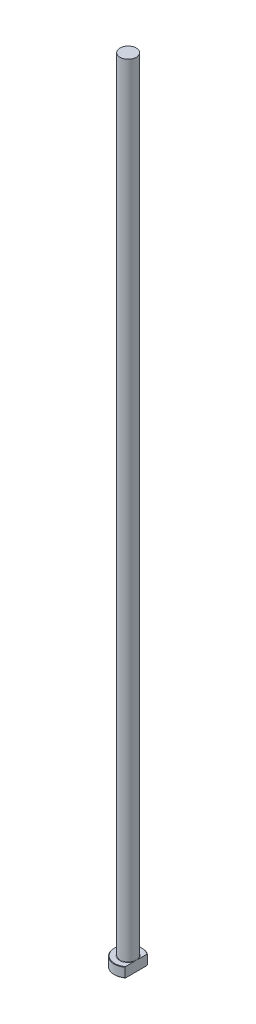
ISO-10303-21;
HEADER;
FILE_DESCRIPTION(('STEP AP214'),'2;1');
FILE_NAME('part.step','',(''),(''),'','','');
FILE_SCHEMA(('AUTOMOTIVE_DESIGN { 1 0 10303 214 1 1 1 1 }'));
ENDSEC;
DATA;
#1=APPLICATION_CONTEXT('core data for automotive mechanical design processes');
#2=APPLICATION_PROTOCOL_DEFINITION('international standard','automotive_design',2000,#1);
#3=PRODUCT_CONTEXT('',#1,'mechanical');
#4=PRODUCT('Part','Part','',(#3));
#5=PRODUCT_RELATED_PRODUCT_CATEGORY('part','',(#4));
#6=PRODUCT_DEFINITION_FORMATION('','',#4);
#7=PRODUCT_DEFINITION_CONTEXT('part definition',#1,'design');
#8=PRODUCT_DEFINITION('design','',#6,#7);
#9=PRODUCT_DEFINITION_SHAPE('','',#8);
#10=(LENGTH_UNIT() NAMED_UNIT(*) SI_UNIT(.MILLI.,.METRE.));
#11=(NAMED_UNIT(*) PLANE_ANGLE_UNIT() SI_UNIT($,.RADIAN.));
#12=(NAMED_UNIT(*) SI_UNIT($,.STERADIAN.) SOLID_ANGLE_UNIT());
#13=UNCERTAINTY_MEASURE_WITH_UNIT(LENGTH_MEASURE(1.E-05),#10,'distance_accuracy_value','');
#14=(GEOMETRIC_REPRESENTATION_CONTEXT(3) GLOBAL_UNCERTAINTY_ASSIGNED_CONTEXT((#13)) GLOBAL_UNIT_ASSIGNED_CONTEXT((#10,
#11,#12)) REPRESENTATION_CONTEXT('',''));
#15=CARTESIAN_POINT('',(0.,0.,0.));
#16=DIRECTION('',(0.,0.,1.));
#17=DIRECTION('',(1.,0.,0.));
#18=AXIS2_PLACEMENT_3D('',#15,#16,#17);
#19=CARTESIAN_POINT('',(0.,0.,0.));
#20=DIRECTION('',(0.,-1.,0.));
#21=DIRECTION('',(0.,0.,-1.));
#22=AXIS2_PLACEMENT_3D('',#19,#20,#21);
#23=PLANE('',#22);
#24=CARTESIAN_POINT('',(0.,0.,0.));
#25=DIRECTION('',(0.,-1.,0.));
#26=DIRECTION('',(0.,0.,-1.));
#27=AXIS2_PLACEMENT_3D('',#24,#25,#26);
#28=CIRCLE('',#27,6.79999999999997);
#29=CARTESIAN_POINT('',(4.09999999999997,0.,5.42494239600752));
#30=VERTEX_POINT('',#29);
#31=CARTESIAN_POINT('',(4.09999999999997,0.,-5.42494239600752));
#32=VERTEX_POINT('',#31);
#33=EDGE_CURVE('E98',#30,#32,#28,.T.);
#34=ORIENTED_EDGE('',*,*,#33,.T.);
#35=DIRECTION('',(0.,0.,1.));
#36=VECTOR('',#35,1.);
#37=CARTESIAN_POINT('',(4.09999999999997,0.,-5.6736231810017));
#38=LINE('',#37,#36);
#39=EDGE_CURVE('E83',#32,#30,#38,.T.);
#40=ORIENTED_EDGE('',*,*,#39,.T.);
#41=EDGE_LOOP('',(#34,#40));
#42=FACE_BOUND('',#41,.T.);
#43=ADVANCED_FACE('F32',(#42),#23,.T.);
#44=CARTESIAN_POINT('',(0.,259.958771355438,0.));
#45=DIRECTION('',(0.,1.,0.));
#46=DIRECTION('',(0.,0.,1.));
#47=AXIS2_PLACEMENT_3D('',#44,#45,#46);
#48=CYLINDRICAL_SURFACE('',#47,6.99999999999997);
#49=CARTESIAN_POINT('',(0.,4.80000000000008,0.));
#50=DIRECTION('',(0.,1.,0.));
#51=DIRECTION('',(0.,0.,1.));
#52=AXIS2_PLACEMENT_3D('',#49,#50,#51);
#53=CIRCLE('',#52,6.99999999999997);
#54=CARTESIAN_POINT('',(4.09999999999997,4.80000000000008,5.6736231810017));
#55=VERTEX_POINT('',#54);
#56=CARTESIAN_POINT('',(4.09999999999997,4.80000000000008,-5.6736231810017));
#57=VERTEX_POINT('',#56);
#58=EDGE_CURVE('E104',#55,#57,#53,.F.);
#59=ORIENTED_EDGE('',*,*,#58,.T.);
#60=DIRECTION('',(0.,-1.,0.));
#61=VECTOR('',#60,1.);
#62=CARTESIAN_POINT('',(4.09999999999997,400.,-5.6736231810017));
#63=LINE('',#62,#61);
#64=CARTESIAN_POINT('',(4.09999999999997,0.199999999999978,-5.6736231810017));
#65=VERTEX_POINT('',#64);
#66=EDGE_CURVE('E183',#57,#65,#63,.T.);
#67=ORIENTED_EDGE('',*,*,#66,.T.);
#68=CARTESIAN_POINT('',(0.,0.199999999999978,0.));
#69=DIRECTION('',(0.,-1.,0.));
#70=DIRECTION('',(0.,0.,-1.));
#71=AXIS2_PLACEMENT_3D('',#68,#69,#70);
#72=CIRCLE('',#71,6.99999999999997);
#73=CARTESIAN_POINT('',(4.09999999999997,0.199999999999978,5.6736231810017));
#74=VERTEX_POINT('',#73);
#75=EDGE_CURVE('E100',#65,#74,#72,.F.);
#76=ORIENTED_EDGE('',*,*,#75,.T.);
#77=DIRECTION('',(0.,-1.,0.));
#78=VECTOR('',#77,1.);
#79=CARTESIAN_POINT('',(4.09999999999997,400.,5.6736231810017));
#80=LINE('',#79,#78);
#81=EDGE_CURVE('E93',#55,#74,#80,.T.);
#82=ORIENTED_EDGE('',*,*,#81,.F.);
#83=EDGE_LOOP('',(#59,#67,#76,#82));
#84=FACE_BOUND('',#83,.T.);
#85=ADVANCED_FACE('F158',(#84),#48,.T.);
#86=CARTESIAN_POINT('',(-6.99999999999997,5.,0.));
#87=DIRECTION('',(0.,1.,0.));
#88=DIRECTION('',(0.,0.,1.));
#89=AXIS2_PLACEMENT_3D('',#86,#87,#88);
#90=PLANE('',#89);
#91=CARTESIAN_POINT('',(0.,5.,0.));
#92=DIRECTION('',(0.,1.,0.));
#93=DIRECTION('',(0.,0.,1.));
#94=AXIS2_PLACEMENT_3D('',#91,#92,#93);
#95=CIRCLE('',#94,6.80000000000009);
#96=CARTESIAN_POINT('',(4.09999999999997,5.,-5.42494239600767));
#97=VERTEX_POINT('',#96);
#98=CARTESIAN_POINT('',(4.09999999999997,5.,5.42494239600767));
#99=VERTEX_POINT('',#98);
#100=EDGE_CURVE('E178',#97,#99,#95,.T.);
#101=ORIENTED_EDGE('',*,*,#100,.T.);
#102=DIRECTION('',(0.,0.,-1.));
#103=VECTOR('',#102,1.);
#104=CARTESIAN_POINT('',(4.09999999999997,5.,0.));
#105=LINE('',#104,#103);
#106=CARTESIAN_POINT('',(4.09999999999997,4.99999999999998,1.29614813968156));
#107=VERTEX_POINT('',#106);
#108=EDGE_CURVE('E57',#99,#107,#105,.T.);
#109=ORIENTED_EDGE('',*,*,#108,.T.);
#110=CARTESIAN_POINT('',(0.,5.,0.));
#111=DIRECTION('',(0.,1.,0.));
#112=DIRECTION('',(0.,0.,1.));
#113=AXIS2_PLACEMENT_3D('',#110,#111,#112);
#114=CIRCLE('',#113,4.29999999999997);
#115=CARTESIAN_POINT('',(4.09999999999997,4.99999999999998,-1.29614813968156));
#116=VERTEX_POINT('',#115);
#117=EDGE_CURVE('E107',#107,#116,#114,.F.);
#118=ORIENTED_EDGE('',*,*,#117,.T.);
#119=EDGE_CURVE('E136',#116,#97,#105,.T.);
#120=ORIENTED_EDGE('',*,*,#119,.T.);
#121=EDGE_LOOP('',(#101,#109,#118,#120));
#122=FACE_BOUND('',#121,.T.);
#123=ADVANCED_FACE('F147',(#122),#90,.T.);
#124=CARTESIAN_POINT('',(0.,5.,0.));
#125=DIRECTION('',(0.,-1.,0.));
#126=DIRECTION('',(0.,0.,-1.));
#127=AXIS2_PLACEMENT_3D('',#124,#125,#126);
#128=CONICAL_SURFACE('',#127,6.80000000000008,0.785398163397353);
#129=ORIENTED_EDGE('',*,*,#58,.F.);
#130=CARTESIAN_POINT('',(4.09999999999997,-1.33929192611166,12.483228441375));
#131=CARTESIAN_POINT('',(4.09999999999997,-1.13691180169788,12.2702073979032));
#132=CARTESIAN_POINT('',(4.09999999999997,-0.934791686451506,12.0569390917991));
#133=CARTESIAN_POINT('',(4.09999999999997,-0.531169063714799,11.6298164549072));
#134=CARTESIAN_POINT('',(4.09999999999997,-0.329666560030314,11.4159621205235));
#135=CARTESIAN_POINT('',(4.09999999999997,0.273965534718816,10.7731725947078));
#136=CARTESIAN_POINT('',(4.09999999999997,0.67501715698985,10.3432236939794));
#137=CARTESIAN_POINT('',(4.09999999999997,1.47875431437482,9.47345436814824));
#138=CARTESIAN_POINT('',(4.09999999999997,1.88138218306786,9.03358046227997));
#139=CARTESIAN_POINT('',(4.09999999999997,2.48056970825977,8.36963259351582));
#140=CARTESIAN_POINT('',(4.09999999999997,2.67946853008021,8.147670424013));
#141=CARTESIAN_POINT('',(4.09999999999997,3.07530374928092,7.70200314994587));
#142=CARTESIAN_POINT('',(4.09999999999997,3.27224016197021,7.47829805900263));
#143=CARTESIAN_POINT('',(4.09999999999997,3.62803580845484,7.06959504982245));
#144=CARTESIAN_POINT('',(4.09999999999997,3.78730687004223,6.88495594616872));
#145=CARTESIAN_POINT('',(4.09999999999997,4.10378434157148,6.51391771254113));
#146=CARTESIAN_POINT('',(4.09999999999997,4.2609907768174,6.3275186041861));
#147=CARTESIAN_POINT('',(4.09999999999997,4.57299335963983,5.95235210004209));
#148=CARTESIAN_POINT('',(4.09999999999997,4.72778657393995,5.76358225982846));
#149=CARTESIAN_POINT('',(4.09999999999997,5.03405385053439,5.38337519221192));
#150=CARTESIAN_POINT('',(4.09999999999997,5.18552806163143,5.19193808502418));
#151=CARTESIAN_POINT('',(4.09999999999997,5.48381165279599,4.80616050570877));
#152=CARTESIAN_POINT('',(4.09999999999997,5.63063104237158,4.61182780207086));
#153=CARTESIAN_POINT('',(4.09999999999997,5.91857329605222,4.218895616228));
#154=CARTESIAN_POINT('',(4.09999999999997,6.05969490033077,4.02029520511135));
#155=CARTESIAN_POINT('',(4.09999999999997,6.3338461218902,3.61807653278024));
#156=CARTESIAN_POINT('',(4.09999999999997,6.46688994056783,3.41446801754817));
#157=CARTESIAN_POINT('',(4.09999999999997,6.72196289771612,3.0005132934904));
#158=CARTESIAN_POINT('',(4.09999999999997,6.8439982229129,2.79017096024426));
#159=CARTESIAN_POINT('',(4.09999999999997,7.04294800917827,2.41613627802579));
#160=CARTESIAN_POINT('',(4.09999999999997,7.12340018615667,2.25434092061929));
#161=CARTESIAN_POINT('',(4.09999999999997,7.27278814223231,1.92538984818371));
#162=CARTESIAN_POINT('',(4.09999999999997,7.34172134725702,1.7582329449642));
#163=CARTESIAN_POINT('',(4.09999999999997,7.46395062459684,1.41984946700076));
#164=CARTESIAN_POINT('',(4.09999999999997,7.51737823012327,1.24867129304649));
#165=CARTESIAN_POINT('',(4.09999999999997,7.6053948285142,0.901532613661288));
#166=CARTESIAN_POINT('',(4.09999999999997,7.63999996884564,0.725576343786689));
#167=CARTESIAN_POINT('',(4.09999999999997,7.68036353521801,0.421086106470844));
#168=CARTESIAN_POINT('',(4.09999999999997,7.69152054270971,0.293260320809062));
#169=CARTESIAN_POINT('',(4.09999999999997,7.70182627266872,0.0371280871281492));
#170=CARTESIAN_POINT('',(4.09999999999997,7.70097696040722,-0.0911782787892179));
#171=CARTESIAN_POINT('',(4.09999999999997,7.68730446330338,-0.347367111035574));
#172=CARTESIAN_POINT('',(4.09999999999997,7.67446010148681,-0.475248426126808));
#173=CARTESIAN_POINT('',(4.09999999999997,7.63752967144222,-0.729373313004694));
#174=CARTESIAN_POINT('',(4.09999999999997,7.6134410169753,-0.855616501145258));
#175=CARTESIAN_POINT('',(4.09999999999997,7.54404317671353,-1.15392625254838));
#176=CARTESIAN_POINT('',(4.09999999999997,7.49413451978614,-1.32492035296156));
#177=CARTESIAN_POINT('',(4.09999999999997,7.37892989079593,-1.66161692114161));
#178=CARTESIAN_POINT('',(4.09999999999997,7.31362410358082,-1.82731593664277));
#179=CARTESIAN_POINT('',(4.09999999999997,7.17079959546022,-2.15435858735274));
#180=CARTESIAN_POINT('',(4.09999999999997,7.0932172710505,-2.31567410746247));
#181=CARTESIAN_POINT('',(4.09999999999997,6.97004119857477,-2.55403843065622));
#182=CARTESIAN_POINT('',(4.09999999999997,6.92785402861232,-2.63288278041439));
#183=CARTESIAN_POINT('',(4.09999999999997,6.84148468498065,-2.78946923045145));
#184=CARTESIAN_POINT('',(4.09999999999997,6.79730258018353,-2.86721136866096));
#185=CARTESIAN_POINT('',(4.09999999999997,6.65934609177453,-3.10372248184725));
#186=CARTESIAN_POINT('',(4.09999999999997,6.56274427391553,-3.26084376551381));
#187=CARTESIAN_POINT('',(4.09999999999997,6.36389133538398,-3.57148434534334));
#188=CARTESIAN_POINT('',(4.09999999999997,6.26163896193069,-3.72500283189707));
#189=CARTESIAN_POINT('',(4.09999999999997,6.05267831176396,-4.02913378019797));
#190=CARTESIAN_POINT('',(4.09999999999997,5.9459667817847,-4.1797439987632));
#191=CARTESIAN_POINT('',(4.09999999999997,5.72908222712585,-4.47845767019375));
#192=CARTESIAN_POINT('',(4.09999999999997,5.61890895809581,-4.62656094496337));
#193=CARTESIAN_POINT('',(4.09999999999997,5.39553225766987,-4.92101937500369));
#194=CARTESIAN_POINT('',(4.09999999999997,5.2823221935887,-5.06736948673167));
#195=CARTESIAN_POINT('',(4.09999999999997,5.05364560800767,-5.3582983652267));
#196=CARTESIAN_POINT('',(4.09999999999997,4.93817902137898,-5.50287708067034));
#197=CARTESIAN_POINT('',(4.09999999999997,4.58900487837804,-5.93440610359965));
#198=CARTESIAN_POINT('',(4.09999999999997,4.35254037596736,-6.21912657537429));
#199=CARTESIAN_POINT('',(4.09999999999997,3.9936802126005,-6.64336157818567));
#200=CARTESIAN_POINT('',(4.09999999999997,3.87318866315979,-6.78450136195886));
#201=CARTESIAN_POINT('',(4.09999999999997,3.63111125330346,-7.06582575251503));
#202=CARTESIAN_POINT('',(4.09999999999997,3.50952546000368,-7.20601041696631));
#203=CARTESIAN_POINT('',(4.09999999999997,3.14334067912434,-7.62537642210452));
#204=CARTESIAN_POINT('',(4.09999999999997,2.89734299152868,-7.90333600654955));
#205=CARTESIAN_POINT('',(4.09999999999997,2.4029383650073,-8.4563615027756));
#206=CARTESIAN_POINT('',(4.09999999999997,2.15453550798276,-8.73143107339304));
#207=CARTESIAN_POINT('',(4.09999999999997,1.65560568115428,-9.2796352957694));
#208=CARTESIAN_POINT('',(4.09999999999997,1.40507871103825,-9.55276994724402));
#209=CARTESIAN_POINT('',(4.09999999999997,0.947239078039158,-10.0488717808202));
#210=CARTESIAN_POINT('',(4.09999999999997,0.740197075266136,-10.2720890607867));
#211=CARTESIAN_POINT('',(4.09999999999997,0.325116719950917,-10.7177199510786));
#212=CARTESIAN_POINT('',(4.09999999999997,0.117078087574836,-10.9401333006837));
#213=CARTESIAN_POINT('',(4.09999999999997,-0.298674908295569,-11.383046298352));
#214=CARTESIAN_POINT('',(4.09999999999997,-0.506385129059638,-11.6035498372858));
#215=CARTESIAN_POINT('',(4.09999999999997,-0.922403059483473,-12.0438652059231));
#216=CARTESIAN_POINT('',(4.09999999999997,-1.13071056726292,-12.2636772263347));
#217=CARTESIAN_POINT('',(4.09999999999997,-1.33929192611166,-12.483228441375));
#218=B_SPLINE_CURVE_WITH_KNOTS('',3,(#130,#131,#132,#133,#134,#135,#136,#137,#138,#139,#140,
#141,#142,#143,#144,#145,#146,#147,#148,#149,#150,#151,#152,#153,#154,#155,#156,#157,#158,#159,
#160,#161,#162,#163,#164,#165,#166,#167,#168,#169,#170,#171,#172,#173,#174,#175,#176,#177,#178,
#179,#180,#181,#182,#183,#184,#185,#186,#187,#188,#189,#190,#191,#192,#193,#194,#195,#196,#197,
#198,#199,#200,#201,#202,#203,#204,#205,#206,#207,#208,#209,#210,#211,#212,#213,#214,#215,#216,
#217),.UNSPECIFIED.,.F.,.F.,(4,2,2,2,2,2,2,2,2,2,2,2,2,2,2,2,2,2,2,2,2,2,2,2,2,2,2,2,2,2,2,2,2,
2,2,2,2,2,2,2,2,2,2,4),(0.,0.881487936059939,1.76298129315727,3.52684938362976,5.31576438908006,
6.20987642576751,7.10398148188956,7.83549529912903,8.56700014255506,9.29933394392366,
10.0316348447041,10.7622363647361,11.4929985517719,12.2224363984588,12.9514617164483,
13.4932089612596,14.0350771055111,14.572204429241,15.1088702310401,15.4932846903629,
15.8776362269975,16.2626676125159,16.6477876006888,17.181194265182,17.7149418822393,
18.2515512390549,18.5197937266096,18.788026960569,19.3411787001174,19.8944535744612,
20.44813940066,21.0018643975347,21.556917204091,22.1119860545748,23.2222096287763,
23.7789368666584,24.3356301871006,25.4491497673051,26.5610293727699,27.6729091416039,
28.5862688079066,29.4999020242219,30.4086844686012,31.3171893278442),.UNSPECIFIED.);
#219=EDGE_CURVE('E135',#55,#99,#218,.T.);
#220=ORIENTED_EDGE('',*,*,#219,.T.);
#221=ORIENTED_EDGE('',*,*,#100,.F.);
#222=EDGE_CURVE('E127',#97,#57,#218,.T.);
#223=ORIENTED_EDGE('',*,*,#222,.T.);
#224=EDGE_LOOP('',(#129,#220,#221,#223));
#225=FACE_BOUND('',#224,.T.);
#226=ADVANCED_FACE('F143',(#225),#128,.T.);
#227=CARTESIAN_POINT('',(0.,0.199999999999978,0.));
#228=DIRECTION('',(0.,1.,0.));
#229=DIRECTION('',(0.,0.,1.));
#230=AXIS2_PLACEMENT_3D('',#227,#228,#229);
#231=CONICAL_SURFACE('',#230,6.99999999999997,0.785398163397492);
#232=ORIENTED_EDGE('',*,*,#75,.F.);
#233=CARTESIAN_POINT('',(4.09999999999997,6.33929192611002,-12.483228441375));
#234=CARTESIAN_POINT('',(4.09999999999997,6.13691180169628,-12.2702073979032));
#235=CARTESIAN_POINT('',(4.09999999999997,5.93479168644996,-12.0569390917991));
#236=CARTESIAN_POINT('',(4.09999999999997,5.53116906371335,-11.6298164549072));
#237=CARTESIAN_POINT('',(4.09999999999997,5.32966656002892,-11.4159621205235));
#238=CARTESIAN_POINT('',(4.09999999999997,4.72603446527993,-10.7731725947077));
#239=CARTESIAN_POINT('',(4.09999999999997,4.324982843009,-10.3432236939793));
#240=CARTESIAN_POINT('',(4.09999999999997,3.52124568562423,-9.47345436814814));
#241=CARTESIAN_POINT('',(4.09999999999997,3.11861781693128,-9.03358046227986));
#242=CARTESIAN_POINT('',(4.09999999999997,2.51943029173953,-8.36963259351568));
#243=CARTESIAN_POINT('',(4.09999999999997,2.32053146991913,-8.14767042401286));
#244=CARTESIAN_POINT('',(4.09999999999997,1.92469625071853,-7.70200314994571));
#245=CARTESIAN_POINT('',(4.09999999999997,1.72775983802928,-7.47829805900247));
#246=CARTESIAN_POINT('',(4.09999999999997,1.37196419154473,-7.06959504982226));
#247=CARTESIAN_POINT('',(4.09999999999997,1.21269312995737,-6.88495594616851));
#248=CARTESIAN_POINT('',(4.09999999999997,0.896215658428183,-6.51391771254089));
#249=CARTESIAN_POINT('',(4.09999999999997,0.739009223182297,-6.32751860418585));
#250=CARTESIAN_POINT('',(4.09999999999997,0.427006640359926,-5.9523521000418));
#251=CARTESIAN_POINT('',(4.09999999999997,0.272213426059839,-5.76358225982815));
#252=CARTESIAN_POINT('',(4.09999999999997,-0.0340538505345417,-5.38337519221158));
#253=CARTESIAN_POINT('',(4.09999999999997,-0.185528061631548,-5.19193808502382));
#254=CARTESIAN_POINT('',(4.09999999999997,-0.483811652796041,-4.80616050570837));
#255=CARTESIAN_POINT('',(4.09999999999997,-0.630631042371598,-4.61182780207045));
#256=CARTESIAN_POINT('',(4.09999999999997,-0.918573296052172,-4.21889561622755));
#257=CARTESIAN_POINT('',(4.09999999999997,-1.05969490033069,-4.02029520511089));
#258=CARTESIAN_POINT('',(4.09999999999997,-1.33384612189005,-3.61807653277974));
#259=CARTESIAN_POINT('',(4.09999999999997,-1.46688994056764,-3.41446801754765));
#260=CARTESIAN_POINT('',(4.09999999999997,-1.72196289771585,-3.00051329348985));
#261=CARTESIAN_POINT('',(4.09999999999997,-1.84399822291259,-2.7901709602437));
#262=CARTESIAN_POINT('',(4.09999999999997,-2.0429480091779,-2.41613627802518));
#263=CARTESIAN_POINT('',(4.09999999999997,-2.12340018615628,-2.25434092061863));
#264=CARTESIAN_POINT('',(4.09999999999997,-2.27278814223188,-1.92538984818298));
#265=CARTESIAN_POINT('',(4.09999999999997,-2.34172134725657,-1.75823294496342));
#266=CARTESIAN_POINT('',(4.09999999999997,-2.46395062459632,-1.4198494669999));
#267=CARTESIAN_POINT('',(4.09999999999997,-2.51737823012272,-1.2486712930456));
#268=CARTESIAN_POINT('',(4.09999999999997,-2.60539482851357,-0.901532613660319));
#269=CARTESIAN_POINT('',(4.09999999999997,-2.63999996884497,-0.725576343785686));
#270=CARTESIAN_POINT('',(4.09999999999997,-2.68036353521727,-0.421086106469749));
#271=CARTESIAN_POINT('',(4.09999999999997,-2.69152054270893,-0.293260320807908));
#272=CARTESIAN_POINT('',(4.09999999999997,-2.70182627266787,-0.0371280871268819));
#273=CARTESIAN_POINT('',(4.09999999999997,-2.70097696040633,0.0911782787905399));
#274=CARTESIAN_POINT('',(4.09999999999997,-2.6873044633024,0.347367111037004));
#275=CARTESIAN_POINT('',(4.09999999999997,-2.67446010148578,0.475248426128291));
#276=CARTESIAN_POINT('',(4.09999999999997,-2.63752967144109,0.729373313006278));
#277=CARTESIAN_POINT('',(4.09999999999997,-2.61344101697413,0.855616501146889));
#278=CARTESIAN_POINT('',(4.09999999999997,-2.54404317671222,1.15392625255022));
#279=CARTESIAN_POINT('',(4.09999999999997,-2.49413451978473,1.32492035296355));
#280=CARTESIAN_POINT('',(4.09999999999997,-2.3789298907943,1.6616169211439));
#281=CARTESIAN_POINT('',(4.09999999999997,-2.31362410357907,1.82731593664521));
#282=CARTESIAN_POINT('',(4.09999999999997,-2.17079959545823,2.15435858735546));
#283=CARTESIAN_POINT('',(4.09999999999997,-2.0932172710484,2.31567410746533));
#284=CARTESIAN_POINT('',(4.09999999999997,-1.97004119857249,2.55403843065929));
#285=CARTESIAN_POINT('',(4.09999999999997,-1.92785402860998,2.63288278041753));
#286=CARTESIAN_POINT('',(4.09999999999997,-1.84148468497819,2.78946923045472));
#287=CARTESIAN_POINT('',(4.09999999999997,-1.797302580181,2.86721136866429));
#288=CARTESIAN_POINT('',(4.09999999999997,-1.65934609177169,3.10372248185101));
#289=CARTESIAN_POINT('',(4.09999999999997,-1.56274427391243,3.26084376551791));
#290=CARTESIAN_POINT('',(4.09999999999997,-1.36389133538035,3.57148434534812));
#291=CARTESIAN_POINT('',(4.09999999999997,-1.26163896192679,3.72500283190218));
#292=CARTESIAN_POINT('',(4.09999999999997,-1.0526783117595,4.02913378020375));
#293=CARTESIAN_POINT('',(4.09999999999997,-0.945966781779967,4.1797439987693));
#294=CARTESIAN_POINT('',(4.09999999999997,-0.72908222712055,4.47845767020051));
#295=CARTESIAN_POINT('',(4.09999999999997,-0.618908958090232,4.62656094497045));
#296=CARTESIAN_POINT('',(4.09999999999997,-0.395532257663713,4.92101937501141));
#297=CARTESIAN_POINT('',(4.09999999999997,-0.282322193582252,5.06736948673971));
#298=CARTESIAN_POINT('',(4.09999999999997,-0.0536456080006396,5.35829836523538));
#299=CARTESIAN_POINT('',(4.09999999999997,0.0618209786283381,5.50287708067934));
#300=CARTESIAN_POINT('',(4.09999999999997,0.41099512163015,5.9344061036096));
#301=CARTESIAN_POINT('',(4.09999999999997,0.647459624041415,6.21912657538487));
#302=CARTESIAN_POINT('',(4.09999999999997,1.00631978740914,6.6433615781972));
#303=CARTESIAN_POINT('',(4.09999999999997,1.12681133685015,6.7845013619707));
#304=CARTESIAN_POINT('',(4.09999999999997,1.36888874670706,7.0658257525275));
#305=CARTESIAN_POINT('',(4.09999999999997,1.49047454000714,7.20601041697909));
#306=CARTESIAN_POINT('',(4.09999999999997,1.85665932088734,7.62537642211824));
#307=CARTESIAN_POINT('',(4.09999999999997,2.10265700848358,7.90333600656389));
#308=CARTESIAN_POINT('',(4.09999999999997,2.59706163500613,8.4563615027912));
#309=CARTESIAN_POINT('',(4.09999999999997,2.84546449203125,8.73143107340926));
#310=CARTESIAN_POINT('',(4.09999999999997,3.34439431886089,9.27963529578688));
#311=CARTESIAN_POINT('',(4.09999999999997,3.5949212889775,9.55276994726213));
#312=CARTESIAN_POINT('',(4.09999999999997,4.0527609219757,10.0488717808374));
#313=CARTESIAN_POINT('',(4.09999999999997,4.25980292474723,10.2720890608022));
#314=CARTESIAN_POINT('',(4.09999999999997,4.67488328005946,10.717719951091));
#315=CARTESIAN_POINT('',(4.09999999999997,4.88292191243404,10.9401333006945));
#316=CARTESIAN_POINT('',(4.09999999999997,5.29867490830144,11.3830462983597));
#317=CARTESIAN_POINT('',(4.09999999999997,5.50638512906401,11.603549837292));
#318=CARTESIAN_POINT('',(4.09999999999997,5.92240305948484,12.0438652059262));
#319=CARTESIAN_POINT('',(4.09999999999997,6.13071056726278,12.2636772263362));
#320=CARTESIAN_POINT('',(4.09999999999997,6.33929192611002,12.483228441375));
#321=B_SPLINE_CURVE_WITH_KNOTS('',3,(#233,#234,#235,#236,#237,#238,#239,#240,#241,#242,#243,
#244,#245,#246,#247,#248,#249,#250,#251,#252,#253,#254,#255,#256,#257,#258,#259,#260,#261,#262,
#263,#264,#265,#266,#267,#268,#269,#270,#271,#272,#273,#274,#275,#276,#277,#278,#279,#280,#281,
#282,#283,#284,#285,#286,#287,#288,#289,#290,#291,#292,#293,#294,#295,#296,#297,#298,#299,#300,
#301,#302,#303,#304,#305,#306,#307,#308,#309,#310,#311,#312,#313,#314,#315,#316,#317,#318,#319,
#320),.UNSPECIFIED.,.F.,.F.,(4,2,2,2,2,2,2,2,2,2,2,2,2,2,2,2,2,2,2,2,2,2,2,2,2,2,2,2,2,2,2,2,2,
2,2,2,2,2,2,2,2,2,2,4),(0.,0.881487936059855,1.7629812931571,3.52684938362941,5.31576438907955,
6.20987642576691,7.10398148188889,7.83549529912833,8.56700014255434,9.29933394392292,
10.0316348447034,10.7622363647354,11.4929985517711,12.222436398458,12.9514617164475,
13.4932089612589,14.0350771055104,14.5722044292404,15.1088702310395,15.4932846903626,
15.8776362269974,16.2626676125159,16.647787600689,17.1811942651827,17.7149418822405,
18.2515512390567,18.5197937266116,18.7880269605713,19.3411787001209,19.8944535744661,
20.4481394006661,21.0018643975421,21.5569172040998,22.1119860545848,23.2222096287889,
23.7789368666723,24.3356301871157,25.4491497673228,26.5610293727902,27.6729091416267,
28.5862688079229,29.4999020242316,30.4086844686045,31.3171893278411),.UNSPECIFIED.);
#322=EDGE_CURVE('E86',#65,#32,#321,.T.);
#323=ORIENTED_EDGE('',*,*,#322,.T.);
#324=ORIENTED_EDGE('',*,*,#33,.F.);
#325=EDGE_CURVE('E89',#30,#74,#321,.T.);
#326=ORIENTED_EDGE('',*,*,#325,.T.);
#327=EDGE_LOOP('',(#232,#323,#324,#326));
#328=FACE_BOUND('',#327,.T.);
#329=ADVANCED_FACE('F97',(#328),#231,.T.);
#330=CARTESIAN_POINT('',(0.,5.19999999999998,0.));
#331=DIRECTION('',(0.,1.,0.));
#332=DIRECTION('',(0.,0.,1.));
#333=AXIS2_PLACEMENT_3D('',#330,#331,#332);
#334=TOROIDAL_SURFACE('',#333,4.29999999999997,0.2);
#335=CARTESIAN_POINT('',(4.09999999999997,5.19999999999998,0.));
#336=CARTESIAN_POINT('',(4.09999999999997,5.20000051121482,8.48177579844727E-11));
#337=CARTESIAN_POINT('',(4.09999999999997,5.2000010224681,-2.37341874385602E-07));
#338=CARTESIAN_POINT('',(4.09999999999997,5.20000197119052,-8.69991321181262E-07));
#339=CARTESIAN_POINT('',(4.09999999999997,5.20000238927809,-1.28223494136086E-06));
#340=CARTESIAN_POINT('',(4.09999999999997,5.20000327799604,-2.27653388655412E-06));
#341=CARTESIAN_POINT('',(4.09999999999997,5.20000373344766,-2.87471299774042E-06));
#342=CARTESIAN_POINT('',(4.09999999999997,5.20000453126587,-4.09830357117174E-06));
#343=CARTESIAN_POINT('',(4.09999999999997,5.20000487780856,-4.72126748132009E-06));
#344=CARTESIAN_POINT('',(4.09999999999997,5.20000620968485,-7.19543436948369E-06));
#345=CARTESIAN_POINT('',(4.09999999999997,5.20000713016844,-9.08507628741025E-06));
#346=CARTESIAN_POINT('',(4.09999999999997,5.20000860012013,-1.27786167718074E-05));
#347=CARTESIAN_POINT('',(4.09999999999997,5.2000091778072,-1.45716794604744E-05));
#348=CARTESIAN_POINT('',(4.09999999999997,5.20001167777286,-2.23278313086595E-05));
#349=CARTESIAN_POINT('',(4.09999999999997,5.20001360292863,-2.82919348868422E-05));
#350=CARTESIAN_POINT('',(4.09999999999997,5.20001636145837,-3.94393207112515E-05));
#351=CARTESIAN_POINT('',(4.09999999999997,5.20001732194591,-4.459065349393E-05));
#352=CARTESIAN_POINT('',(4.09999999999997,5.20002443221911,-8.33481274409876E-05));
#353=CARTESIAN_POINT('',(4.09999999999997,5.20002995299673,-0.000117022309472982));
#354=CARTESIAN_POINT('',(4.09999999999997,5.20005411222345,-0.000250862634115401));
#355=CARTESIAN_POINT('',(4.09999999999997,5.20007702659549,-0.000350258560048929));
#356=CARTESIAN_POINT('',(4.09999999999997,5.20016686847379,-0.000745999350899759));
#357=CARTESIAN_POINT('',(4.09999999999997,5.20023113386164,-0.00104273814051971));
#358=CARTESIAN_POINT('',(4.09999999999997,5.20048975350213,-0.00222871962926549));
#359=CARTESIAN_POINT('',(4.09999999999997,5.20068752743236,-0.00311743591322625));
#360=CARTESIAN_POINT('',(4.09999999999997,5.20151360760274,-0.00683863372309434));
#361=CARTESIAN_POINT('',(4.09999999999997,5.20213761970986,-0.00967177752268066));
#362=CARTESIAN_POINT('',(4.09999999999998,5.21060513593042,-0.0481053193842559));
#363=CARTESIAN_POINT('',(4.09999999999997,5.21847514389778,-0.0837019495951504));
#364=CARTESIAN_POINT('',(4.09999999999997,5.23497753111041,-0.15888321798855));
#365=CARTESIAN_POINT('',(4.09999999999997,5.24359721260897,-0.198470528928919));
#366=CARTESIAN_POINT('',(4.09999999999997,5.25810552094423,-0.266014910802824));
#367=CARTESIAN_POINT('',(4.09999999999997,5.26405008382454,-0.293959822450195));
#368=CARTESIAN_POINT('',(4.09999999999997,5.27562355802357,-0.34912552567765));
#369=CARTESIAN_POINT('',(4.09999999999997,5.28125665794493,-0.376345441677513));
#370=CARTESIAN_POINT('',(4.09999999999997,5.29943979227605,-0.46575599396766));
#371=CARTESIAN_POINT('',(4.09999999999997,5.31159607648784,-0.528028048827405));
#372=CARTESIAN_POINT('',(4.09999999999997,5.3345183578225,-0.653452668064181));
#373=CARTESIAN_POINT('',(4.09999999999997,5.34526982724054,-0.716607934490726));
#374=CARTESIAN_POINT('',(4.09999999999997,5.36549989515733,-0.849208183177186));
#375=CARTESIAN_POINT('',(4.09999999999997,5.37476398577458,-0.918686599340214));
#376=CARTESIAN_POINT('',(4.09999999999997,5.38955225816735,-1.05786044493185));
#377=CARTESIAN_POINT('',(4.09999999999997,5.39508786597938,-1.12755454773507));
#378=CARTESIAN_POINT('',(4.09999999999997,5.3992964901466,-1.23112590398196));
#379=CARTESIAN_POINT('',(4.09999999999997,5.40003705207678,-1.26491756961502));
#380=CARTESIAN_POINT('',(4.09999999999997,5.39995996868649,-1.33249559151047));
#381=CARTESIAN_POINT('',(4.09999999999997,5.39914270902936,-1.36628194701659));
#382=CARTESIAN_POINT('',(4.09999999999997,5.39557880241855,-1.43339843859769));
#383=CARTESIAN_POINT('',(4.09999999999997,5.39285312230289,-1.46672955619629));
#384=CARTESIAN_POINT('',(4.09999999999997,5.3849220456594,-1.53304911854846));
#385=CARTESIAN_POINT('',(4.09999999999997,5.37972044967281,-1.56603800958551));
#386=CARTESIAN_POINT('',(4.09999999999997,5.36576321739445,-1.63210333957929));
#387=CARTESIAN_POINT('',(4.09999999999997,5.35693238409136,-1.66516593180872));
#388=CARTESIAN_POINT('',(4.09999999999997,5.33956496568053,-1.71313701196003));
#389=CARTESIAN_POINT('',(4.09999999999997,5.33312382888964,-1.72879572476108));
#390=CARTESIAN_POINT('',(4.09999999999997,5.31841020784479,-1.75921181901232));
#391=CARTESIAN_POINT('',(4.09999999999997,5.31014484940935,-1.77397243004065));
#392=CARTESIAN_POINT('',(4.09999999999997,5.29597609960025,-1.79459137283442));
#393=CARTESIAN_POINT('',(4.09999999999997,5.29105059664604,-1.80111732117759));
#394=CARTESIAN_POINT('',(4.09999999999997,5.28047159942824,-1.81356806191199));
#395=CARTESIAN_POINT('',(4.09999999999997,5.27481806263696,-1.81949281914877));
#396=CARTESIAN_POINT('',(4.09999999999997,5.26378662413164,-1.82942177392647));
#397=CARTESIAN_POINT('',(4.09999999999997,5.25854825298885,-1.83357893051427));
#398=CARTESIAN_POINT('',(4.09999999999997,5.24747881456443,-1.8410175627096));
#399=CARTESIAN_POINT('',(4.09999999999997,5.24164898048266,-1.84430081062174));
#400=CARTESIAN_POINT('',(4.09999999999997,5.23103019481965,-1.84897077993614));
#401=CARTESIAN_POINT('',(4.09999999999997,5.22636142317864,-1.85062832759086));
#402=CARTESIAN_POINT('',(4.09999999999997,5.21681344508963,-1.85314556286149));
#403=CARTESIAN_POINT('',(4.09999999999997,5.21193447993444,-1.85400614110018));
#404=CARTESIAN_POINT('',(4.09999999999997,5.2020790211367,-1.8548454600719));
#405=CARTESIAN_POINT('',(4.09999999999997,5.19710220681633,-1.85482052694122));
#406=CARTESIAN_POINT('',(4.09999999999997,5.18723254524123,-1.85388227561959));
#407=CARTESIAN_POINT('',(4.09999999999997,5.18233974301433,-1.8529684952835));
#408=CARTESIAN_POINT('',(4.09999999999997,5.17301169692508,-1.85041011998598));
#409=CARTESIAN_POINT('',(4.09999999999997,5.16856577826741,-1.84880345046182));
#410=CARTESIAN_POINT('',(4.09999999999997,5.15994310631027,-1.84499014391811));
#411=CARTESIAN_POINT('',(4.09999999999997,5.15576643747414,-1.84278331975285));
#412=CARTESIAN_POINT('',(4.09999999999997,5.1448604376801,-1.83616140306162));
#413=CARTESIAN_POINT('',(4.09999999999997,5.13841060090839,-1.8312871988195));
#414=CARTESIAN_POINT('',(4.09999999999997,5.12632402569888,-1.82061430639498));
#415=CARTESIAN_POINT('',(4.09999999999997,5.12069027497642,-1.81481237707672));
#416=CARTESIAN_POINT('',(4.09999999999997,5.10569835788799,-1.79748307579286));
#417=CARTESIAN_POINT('',(4.09999999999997,5.0971810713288,-1.78523612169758));
#418=CARTESIAN_POINT('',(4.09999999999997,5.08190874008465,-1.759730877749));
#419=CARTESIAN_POINT('',(4.09999999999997,5.07515617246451,-1.74647119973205));
#420=CARTESIAN_POINT('',(4.09999999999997,5.06057670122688,-1.71404296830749));
#421=CARTESIAN_POINT('',(4.09999999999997,5.05336936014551,-1.69459894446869));
#422=CARTESIAN_POINT('',(4.09999999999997,5.04078670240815,-1.65511361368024));
#423=CARTESIAN_POINT('',(4.09999999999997,5.03541518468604,-1.63507116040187));
#424=CARTESIAN_POINT('',(4.09999999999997,5.02602669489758,-1.59438056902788));
#425=CARTESIAN_POINT('',(4.09999999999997,5.02202979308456,-1.57372787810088));
#426=CARTESIAN_POINT('',(4.09999999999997,5.01520764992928,-1.53226128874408));
#427=CARTESIAN_POINT('',(4.09999999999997,5.01238102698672,-1.51144761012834));
#428=CARTESIAN_POINT('',(4.09999999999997,5.00618826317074,-1.45642510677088));
#429=CARTESIAN_POINT('',(4.09999999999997,5.00362476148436,-1.42212636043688));
#430=CARTESIAN_POINT('',(4.09999999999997,5.00045800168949,-1.35343324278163));
#431=CARTESIAN_POINT('',(4.09999999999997,4.99985588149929,-1.31903882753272));
#432=CARTESIAN_POINT('',(4.09999999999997,5.00037893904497,-1.21560964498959));
#433=CARTESIAN_POINT('',(4.09999999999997,5.00385566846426,-1.14658832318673));
#434=CARTESIAN_POINT('',(4.09999999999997,5.01464295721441,-1.01357004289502));
#435=CARTESIAN_POINT('',(4.09999999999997,5.02167983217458,-0.949547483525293));
#436=CARTESIAN_POINT('',(4.09999999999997,5.03833051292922,-0.822416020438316));
#437=CARTESIAN_POINT('',(4.09999999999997,5.04792112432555,-0.759304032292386));
#438=CARTESIAN_POINT('',(4.09999999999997,5.06649836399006,-0.648156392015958));
#439=CARTESIAN_POINT('',(4.09999999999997,5.07509963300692,-0.60005440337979));
#440=CARTESIAN_POINT('',(4.09999999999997,5.09336865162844,-0.5027171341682));
#441=CARTESIAN_POINT('',(4.09999999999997,5.10305882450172,-0.45348607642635));
#442=CARTESIAN_POINT('',(4.09999999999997,5.12010265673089,-0.369650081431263));
#443=CARTESIAN_POINT('',(4.09999999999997,5.1273025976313,-0.335013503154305));
#444=CARTESIAN_POINT('',(4.09999999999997,5.14184386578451,-0.26617579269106));
#445=CARTESIAN_POINT('',(4.09999999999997,5.14918270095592,-0.231974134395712));
#446=CARTESIAN_POINT('',(4.09999999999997,5.16314314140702,-0.167541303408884));
#447=CARTESIAN_POINT('',(4.09999999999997,5.16974991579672,-0.137306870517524));
#448=CARTESIAN_POINT('',(4.09999999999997,5.18332308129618,-0.0755506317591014));
#449=CARTESIAN_POINT('',(4.09999999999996,5.19029270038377,-0.0440294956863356));
#450=CARTESIAN_POINT('',(4.09999999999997,5.19786353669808,-0.00966658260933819));
#451=CARTESIAN_POINT('',(4.09999999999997,5.19848867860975,-0.00682823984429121));
#452=CARTESIAN_POINT('',(4.09999999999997,5.19931502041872,-0.00310588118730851));
#453=CARTESIAN_POINT('',(4.09999999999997,5.19951189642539,-0.00222119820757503));
#454=CARTESIAN_POINT('',(4.09999999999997,5.19976942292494,-0.00104022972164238));
#455=CARTESIAN_POINT('',(4.09999999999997,5.19983347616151,-0.000744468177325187));
#456=CARTESIAN_POINT('',(4.09999999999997,5.19992306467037,-0.000349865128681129));
#457=CARTESIAN_POINT('',(4.09999999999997,5.1999459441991,-0.000250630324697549));
#458=CARTESIAN_POINT('',(4.09999999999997,5.19997007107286,-0.000116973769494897));
#459=CARTESIAN_POINT('',(4.09999999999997,5.19997558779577,-8.33211280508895E-05));
#460=CARTESIAN_POINT('',(4.09999999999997,5.19998268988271,-4.45857715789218E-05));
#461=CARTESIAN_POINT('',(4.09999999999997,5.19998364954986,-3.94355404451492E-05));
#462=CARTESIAN_POINT('',(4.09999999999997,5.19998640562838,-2.82904942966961E-05));
#463=CARTESIAN_POINT('',(4.09999999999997,5.19998832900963,-2.23275713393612E-05));
#464=CARTESIAN_POINT('',(4.09999999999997,5.19999082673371,-1.45726655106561E-05));
#465=CARTESIAN_POINT('',(4.09999999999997,5.19999140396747,-1.27796833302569E-05));
#466=CARTESIAN_POINT('',(4.09999999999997,5.19999287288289,-9.08623741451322E-06));
#467=CARTESIAN_POINT('',(4.09999999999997,5.19999379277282,-7.19659802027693E-06));
#468=CARTESIAN_POINT('',(4.09999999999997,5.19999512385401,-4.72235852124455E-06));
#469=CARTESIAN_POINT('',(4.09999999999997,5.1999954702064,-4.0993503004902E-06));
#470=CARTESIAN_POINT('',(4.09999999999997,5.19999626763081,-2.87563677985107E-06));
#471=CARTESIAN_POINT('',(4.09999999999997,5.19999672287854,-2.2773772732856E-06));
#472=CARTESIAN_POINT('',(4.09999999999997,5.19999761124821,-1.28289389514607E-06));
#473=CARTESIAN_POINT('',(4.09999999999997,5.19999802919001,-8.70554048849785E-07));
#474=CARTESIAN_POINT('',(4.09999999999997,5.19999897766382,-2.3765555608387E-07));
#475=CARTESIAN_POINT('',(4.09999999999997,5.19999948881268,-8.48131903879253E-11));
#476=CARTESIAN_POINT('',(4.09999999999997,5.19999999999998,0.));
#477=B_SPLINE_CURVE_WITH_KNOTS('',3,(#335,#336,#337,#338,#339,#340,#341,#342,#343,#344,#345,
#346,#347,#348,#349,#350,#351,#352,#353,#354,#355,#356,#357,#358,#359,#360,#361,#362,#363,#364,
#365,#366,#367,#368,#369,#370,#371,#372,#373,#374,#375,#376,#377,#378,#379,#380,#381,#382,#383,
#384,#385,#386,#387,#388,#389,#390,#391,#392,#393,#394,#395,#396,#397,#398,#399,#400,#401,#402,
#403,#404,#405,#406,#407,#408,#409,#410,#411,#412,#413,#414,#415,#416,#417,#418,#419,#420,#421,
#422,#423,#424,#425,#426,#427,#428,#429,#430,#431,#432,#433,#434,#435,#436,#437,#438,#439,#440,
#441,#442,#443,#444,#445,#446,#447,#448,#449,#450,#451,#452,#453,#454,#455,#456,#457,#458,#459,
#460,#461,#462,#463,#464,#465,#466,#467,#468,#469,#470,#471,#472,#473,#474,#475,#476),
.UNSPECIFIED.,.T.,.F.,(4,2,2,2,2,2,2,2,2,2,2,2,2,2,2,2,2,2,2,2,2,2,2,2,2,2,2,2,2,2,2,2,2,2,2,2,
2,2,2,2,2,2,2,2,2,2,2,2,2,2,2,2,2,2,2,2,2,2,2,2,2,2,2,2,2,2,2,2,2,2,4),(0.,1.56077961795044E-06,
3.3330233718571E-06,5.57220089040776E-06,7.71031786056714E-06,1.39959462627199E-05,
1.96420817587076E-05,3.84177478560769E-05,5.41207073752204E-05,0.000156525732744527,
0.000462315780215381,0.00137340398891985,0.00410448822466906,0.0128079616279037,
0.122174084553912,0.243719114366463,0.329429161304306,0.41281904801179,0.603149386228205,
0.795314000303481,1.0055338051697,1.21510641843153,1.31647802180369,1.41782453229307,
1.51807472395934,1.61817152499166,1.72045618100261,1.77118252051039,1.82171411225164,
1.84620451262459,1.87069634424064,1.89069743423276,1.91065764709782,1.92546132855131,
1.94024844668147,1.9550969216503,1.96995312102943,1.98408278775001,1.99821686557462,
2.02232905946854,2.04652741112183,2.09102796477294,2.13559065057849,2.19765435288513,
2.25984571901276,2.32290998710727,2.38589958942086,2.489000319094,2.59216085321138,
2.79925959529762,2.99242441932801,3.18389136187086,3.33047882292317,3.48099951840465,
3.58712985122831,3.69206963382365,3.78491369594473,3.88175875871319,3.89047819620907,
3.89319688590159,3.89410497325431,3.89441026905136,3.8945126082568,3.89452830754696,
3.8945470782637,3.89455272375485,3.89455900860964,3.89456114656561,3.89456338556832,
3.8945651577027,3.89456671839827),.UNSPECIFIED.);
#478=CARTESIAN_POINT('',(4.09999999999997,5.19999999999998,0.));
#479=VERTEX_POINT('',#478);
#480=EDGE_CURVE('E11',#116,#479,#477,.T.);
#481=ORIENTED_EDGE('',*,*,#480,.F.);
#482=ORIENTED_EDGE('',*,*,#117,.F.);
#483=CARTESIAN_POINT('',(4.09999999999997,5.19999999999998,0.));
#484=CARTESIAN_POINT('',(4.09999999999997,5.19999948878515,-8.48181322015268E-11));
#485=CARTESIAN_POINT('',(4.09999999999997,5.19999897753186,2.37341874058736E-07));
#486=CARTESIAN_POINT('',(4.09999999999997,5.19999802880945,8.69991321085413E-07));
#487=CARTESIAN_POINT('',(4.09999999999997,5.19999761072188,1.28223494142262E-06));
#488=CARTESIAN_POINT('',(4.09999999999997,5.19999672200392,2.27653388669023E-06));
#489=CARTESIAN_POINT('',(4.09999999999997,5.1999962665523,2.874712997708E-06));
#490=CARTESIAN_POINT('',(4.09999999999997,5.19999546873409,4.0983035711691E-06));
#491=CARTESIAN_POINT('',(4.09999999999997,5.1999951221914,4.72126748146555E-06));
#492=CARTESIAN_POINT('',(4.09999999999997,5.19999379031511,7.19543437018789E-06));
#493=CARTESIAN_POINT('',(4.09999999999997,5.19999286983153,9.0850762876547E-06));
#494=CARTESIAN_POINT('',(4.09999999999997,5.19999139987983,1.27786167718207E-05));
#495=CARTESIAN_POINT('',(4.09999999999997,5.19999082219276,1.45716794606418E-05));
#496=CARTESIAN_POINT('',(4.09999999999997,5.1999883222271,2.2327831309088E-05));
#497=CARTESIAN_POINT('',(4.09999999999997,5.19998639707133,2.82919348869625E-05));
#498=CARTESIAN_POINT('',(4.09999999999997,5.19998363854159,3.94393207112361E-05));
#499=CARTESIAN_POINT('',(4.09999999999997,5.19998267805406,4.45906534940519E-05));
#500=CARTESIAN_POINT('',(4.09999999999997,5.19997556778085,8.33481274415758E-05));
#501=CARTESIAN_POINT('',(4.09999999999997,5.19997004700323,0.000117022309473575));
#502=CARTESIAN_POINT('',(4.09999999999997,5.19994588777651,0.000250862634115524));
#503=CARTESIAN_POINT('',(4.09999999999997,5.19992297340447,0.000350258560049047));
#504=CARTESIAN_POINT('',(4.09999999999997,5.19983313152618,0.000745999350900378));
#505=CARTESIAN_POINT('',(4.09999999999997,5.19976886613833,0.00104273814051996));
#506=CARTESIAN_POINT('',(4.09999999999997,5.19951024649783,0.00222871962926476));
#507=CARTESIAN_POINT('',(4.09999999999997,5.1993124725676,0.00311743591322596));
#508=CARTESIAN_POINT('',(4.09999999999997,5.19848639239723,0.00683863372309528));
#509=CARTESIAN_POINT('',(4.09999999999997,5.19786238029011,0.0096717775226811));
#510=CARTESIAN_POINT('',(4.09999999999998,5.18939486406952,0.0481053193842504));
#511=CARTESIAN_POINT('',(4.09999999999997,5.18152485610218,0.0837019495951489));
#512=CARTESIAN_POINT('',(4.09999999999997,5.16502246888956,0.158883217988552));
#513=CARTESIAN_POINT('',(4.09999999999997,5.156402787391,0.19847052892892));
#514=CARTESIAN_POINT('',(4.09999999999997,5.14189447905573,0.266014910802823));
#515=CARTESIAN_POINT('',(4.09999999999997,5.13594991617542,0.293959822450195));
#516=CARTESIAN_POINT('',(4.09999999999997,5.12437644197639,0.34912552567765));
#517=CARTESIAN_POINT('',(4.09999999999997,5.11874334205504,0.376345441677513));
#518=CARTESIAN_POINT('',(4.09999999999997,5.10056020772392,0.46575599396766));
#519=CARTESIAN_POINT('',(4.09999999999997,5.08840392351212,0.528028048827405));
#520=CARTESIAN_POINT('',(4.09999999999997,5.06548164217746,0.65345266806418));
#521=CARTESIAN_POINT('',(4.09999999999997,5.05473017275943,0.716607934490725));
#522=CARTESIAN_POINT('',(4.09999999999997,5.03450010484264,0.849208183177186));
#523=CARTESIAN_POINT('',(4.09999999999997,5.02523601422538,0.918686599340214));
#524=CARTESIAN_POINT('',(4.09999999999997,5.01044774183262,1.05786044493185));
#525=CARTESIAN_POINT('',(4.09999999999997,5.00491213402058,1.12755454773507));
#526=CARTESIAN_POINT('',(4.09999999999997,5.00070350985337,1.23112590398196));
#527=CARTESIAN_POINT('',(4.09999999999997,4.99996294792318,1.26491756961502));
#528=CARTESIAN_POINT('',(4.09999999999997,5.00004003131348,1.33249559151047));
#529=CARTESIAN_POINT('',(4.09999999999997,5.00085729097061,1.36628194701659));
#530=CARTESIAN_POINT('',(4.09999999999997,5.00442119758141,1.43339843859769));
#531=CARTESIAN_POINT('',(4.09999999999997,5.00714687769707,1.46672955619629));
#532=CARTESIAN_POINT('',(4.09999999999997,5.01507795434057,1.53304911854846));
#533=CARTESIAN_POINT('',(4.09999999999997,5.02027955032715,1.56603800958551));
#534=CARTESIAN_POINT('',(4.09999999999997,5.03423678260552,1.63210333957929));
#535=CARTESIAN_POINT('',(4.09999999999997,5.04306761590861,1.66516593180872));
#536=CARTESIAN_POINT('',(4.09999999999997,5.06043503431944,1.71313701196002));
#537=CARTESIAN_POINT('',(4.09999999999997,5.06687617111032,1.72879572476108));
#538=CARTESIAN_POINT('',(4.09999999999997,5.08158979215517,1.75921181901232));
#539=CARTESIAN_POINT('',(4.09999999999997,5.08985515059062,1.77397243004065));
#540=CARTESIAN_POINT('',(4.09999999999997,5.10402390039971,1.79459137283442));
#541=CARTESIAN_POINT('',(4.09999999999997,5.10894940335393,1.8011173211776));
#542=CARTESIAN_POINT('',(4.09999999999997,5.11952840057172,1.81356806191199));
#543=CARTESIAN_POINT('',(4.09999999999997,5.12518193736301,1.81949281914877));
#544=CARTESIAN_POINT('',(4.09999999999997,5.13621337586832,1.82942177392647));
#545=CARTESIAN_POINT('',(4.09999999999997,5.14145174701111,1.83357893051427));
#546=CARTESIAN_POINT('',(4.09999999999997,5.15252118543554,1.8410175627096));
#547=CARTESIAN_POINT('',(4.09999999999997,5.1583510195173,1.84430081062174));
#548=CARTESIAN_POINT('',(4.09999999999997,5.16896980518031,1.84897077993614));
#549=CARTESIAN_POINT('',(4.09999999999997,5.17363857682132,1.85062832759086));
#550=CARTESIAN_POINT('',(4.09999999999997,5.18318655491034,1.85314556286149));
#551=CARTESIAN_POINT('',(4.09999999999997,5.18806552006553,1.85400614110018));
#552=CARTESIAN_POINT('',(4.09999999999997,5.19792097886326,1.8548454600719));
#553=CARTESIAN_POINT('',(4.09999999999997,5.20289779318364,1.85482052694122));
#554=CARTESIAN_POINT('',(4.09999999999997,5.21276745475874,1.85388227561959));
#555=CARTESIAN_POINT('',(4.09999999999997,5.21766025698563,1.8529684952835));
#556=CARTESIAN_POINT('',(4.09999999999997,5.22698830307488,1.85041011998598));
#557=CARTESIAN_POINT('',(4.09999999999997,5.23143422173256,1.84880345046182));
#558=CARTESIAN_POINT('',(4.09999999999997,5.2400568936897,1.84499014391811));
#559=CARTESIAN_POINT('',(4.09999999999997,5.24423356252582,1.84278331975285));
#560=CARTESIAN_POINT('',(4.09999999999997,5.25513956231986,1.83616140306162));
#561=CARTESIAN_POINT('',(4.09999999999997,5.26158939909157,1.8312871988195));
#562=CARTESIAN_POINT('',(4.09999999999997,5.27367597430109,1.82061430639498));
#563=CARTESIAN_POINT('',(4.09999999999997,5.27930972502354,1.81481237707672));
#564=CARTESIAN_POINT('',(4.09999999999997,5.29430164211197,1.79748307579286));
#565=CARTESIAN_POINT('',(4.09999999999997,5.30281892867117,1.78523612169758));
#566=CARTESIAN_POINT('',(4.09999999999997,5.31809125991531,1.759730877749));
#567=CARTESIAN_POINT('',(4.09999999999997,5.32484382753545,1.74647119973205));
#568=CARTESIAN_POINT('',(4.09999999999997,5.33942329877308,1.71404296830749));
#569=CARTESIAN_POINT('',(4.09999999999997,5.34663063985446,1.69459894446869));
#570=CARTESIAN_POINT('',(4.09999999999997,5.35921329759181,1.65511361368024));
#571=CARTESIAN_POINT('',(4.09999999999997,5.36458481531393,1.63507116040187));
#572=CARTESIAN_POINT('',(4.09999999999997,5.37397330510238,1.59438056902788));
#573=CARTESIAN_POINT('',(4.09999999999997,5.3779702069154,1.57372787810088));
#574=CARTESIAN_POINT('',(4.09999999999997,5.38479235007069,1.53226128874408));
#575=CARTESIAN_POINT('',(4.09999999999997,5.38761897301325,1.51144761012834));
#576=CARTESIAN_POINT('',(4.09999999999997,5.39381173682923,1.45642510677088));
#577=CARTESIAN_POINT('',(4.09999999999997,5.3963752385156,1.42212636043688));
#578=CARTESIAN_POINT('',(4.09999999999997,5.39954199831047,1.35343324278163));
#579=CARTESIAN_POINT('',(4.09999999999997,5.40014411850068,1.31903882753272));
#580=CARTESIAN_POINT('',(4.09999999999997,5.39962106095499,1.21560964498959));
#581=CARTESIAN_POINT('',(4.09999999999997,5.3961443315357,1.14658832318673));
#582=CARTESIAN_POINT('',(4.09999999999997,5.38535704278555,1.01357004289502));
#583=CARTESIAN_POINT('',(4.09999999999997,5.37832016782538,0.949547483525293));
#584=CARTESIAN_POINT('',(4.09999999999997,5.36166948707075,0.822416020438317));
#585=CARTESIAN_POINT('',(4.09999999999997,5.35207887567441,0.759304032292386));
#586=CARTESIAN_POINT('',(4.09999999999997,5.33350163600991,0.648156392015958));
#587=CARTESIAN_POINT('',(4.09999999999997,5.32490036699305,0.60005440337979));
#588=CARTESIAN_POINT('',(4.09999999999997,5.30663134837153,0.5027171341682));
#589=CARTESIAN_POINT('',(4.09999999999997,5.29694117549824,0.453486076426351));
#590=CARTESIAN_POINT('',(4.09999999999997,5.27989734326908,0.369650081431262));
#591=CARTESIAN_POINT('',(4.09999999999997,5.27269740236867,0.335013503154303));
#592=CARTESIAN_POINT('',(4.09999999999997,5.25815613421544,0.266175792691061));
#593=CARTESIAN_POINT('',(4.09999999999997,5.25081729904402,0.231974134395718));
#594=CARTESIAN_POINT('',(4.09999999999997,5.23685685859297,0.167541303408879));
#595=CARTESIAN_POINT('',(4.09999999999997,5.23025008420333,0.137306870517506));
#596=CARTESIAN_POINT('',(4.09999999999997,5.21667691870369,0.0755506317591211));
#597=CARTESIAN_POINT('',(4.09999999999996,5.20970729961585,0.0440294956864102));
#598=CARTESIAN_POINT('',(4.09999999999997,5.20213646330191,0.00966658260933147));
#599=CARTESIAN_POINT('',(4.09999999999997,5.20151132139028,0.00682823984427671));
#600=CARTESIAN_POINT('',(4.09999999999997,5.20068497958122,0.00310588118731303));
#601=CARTESIAN_POINT('',(4.09999999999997,5.20048810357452,0.00222119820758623));
#602=CARTESIAN_POINT('',(4.09999999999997,5.20023057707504,0.00104022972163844));
#603=CARTESIAN_POINT('',(4.09999999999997,5.2001665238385,0.000744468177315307));
#604=CARTESIAN_POINT('',(4.09999999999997,5.20007693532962,0.000349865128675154));
#605=CARTESIAN_POINT('',(4.09999999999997,5.20005405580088,0.000250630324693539));
#606=CARTESIAN_POINT('',(4.09999999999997,5.20002992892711,0.000116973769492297));
#607=CARTESIAN_POINT('',(4.09999999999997,5.20002441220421,8.33211280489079E-05));
#608=CARTESIAN_POINT('',(4.09999999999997,5.20001731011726,4.45857715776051E-05));
#609=CARTESIAN_POINT('',(4.09999999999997,5.20001635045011,3.94355404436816E-05));
#610=CARTESIAN_POINT('',(4.09999999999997,5.20001359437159,2.82904942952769E-05));
#611=CARTESIAN_POINT('',(4.09999999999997,5.20001167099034,2.23275713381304E-05));
#612=CARTESIAN_POINT('',(4.09999999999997,5.20000917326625,1.45726655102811E-05));
#613=CARTESIAN_POINT('',(4.09999999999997,5.2000085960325,1.27796833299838E-05));
#614=CARTESIAN_POINT('',(4.09999999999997,5.20000712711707,9.08623741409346E-06));
#615=CARTESIAN_POINT('',(4.09999999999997,5.20000620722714,7.19659801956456E-06));
#616=CARTESIAN_POINT('',(4.09999999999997,5.20000487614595,4.72235852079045E-06));
#617=CARTESIAN_POINT('',(4.09999999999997,5.20000452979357,4.09935030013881E-06));
#618=CARTESIAN_POINT('',(4.09999999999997,5.20000373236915,2.875636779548E-06));
#619=CARTESIAN_POINT('',(4.09999999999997,5.20000327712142,2.27737727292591E-06));
#620=CARTESIAN_POINT('',(4.09999999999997,5.20000238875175,1.28289389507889E-06));
#621=CARTESIAN_POINT('',(4.09999999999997,5.20000197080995,8.7055404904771E-07));
#622=CARTESIAN_POINT('',(4.09999999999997,5.20000102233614,2.37655556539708E-07));
#623=CARTESIAN_POINT('',(4.09999999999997,5.20000051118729,8.48135644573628E-11));
#624=CARTESIAN_POINT('',(4.09999999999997,5.19999999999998,0.));
#625=B_SPLINE_CURVE_WITH_KNOTS('',3,(#483,#484,#485,#486,#487,#488,#489,#490,#491,#492,#493,
#494,#495,#496,#497,#498,#499,#500,#501,#502,#503,#504,#505,#506,#507,#508,#509,#510,#511,#512,
#513,#514,#515,#516,#517,#518,#519,#520,#521,#522,#523,#524,#525,#526,#527,#528,#529,#530,#531,
#532,#533,#534,#535,#536,#537,#538,#539,#540,#541,#542,#543,#544,#545,#546,#547,#548,#549,#550,
#551,#552,#553,#554,#555,#556,#557,#558,#559,#560,#561,#562,#563,#564,#565,#566,#567,#568,#569,
#570,#571,#572,#573,#574,#575,#576,#577,#578,#579,#580,#581,#582,#583,#584,#585,#586,#587,#588,
#589,#590,#591,#592,#593,#594,#595,#596,#597,#598,#599,#600,#601,#602,#603,#604,#605,#606,#607,
#608,#609,#610,#611,#612,#613,#614,#615,#616,#617,#618,#619,#620,#621,#622,#623,#624),
.UNSPECIFIED.,.T.,.F.,(4,2,2,2,2,2,2,2,2,2,2,2,2,2,2,2,2,2,2,2,2,2,2,2,2,2,2,2,2,2,2,2,2,2,2,2,
2,2,2,2,2,2,2,2,2,2,2,2,2,2,2,2,2,2,2,2,2,2,2,2,2,2,2,2,2,2,2,2,2,2,4),(0.,1.56077961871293E-06,
3.33302337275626E-06,5.5722008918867E-06,7.71031786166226E-06,1.3995946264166E-05,
1.9642081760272E-05,3.84177478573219E-05,5.41207073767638E-05,0.000156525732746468,
0.00046231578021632,0.00137340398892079,0.00410448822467,0.0128079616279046,0.122174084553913,
0.243719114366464,0.329429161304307,0.412819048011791,0.603149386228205,0.795314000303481,
1.0055338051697,1.21510641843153,1.31647802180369,1.41782453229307,1.51807472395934,
1.61817152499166,1.72045618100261,1.77118252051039,1.82171411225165,1.8462045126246,
1.87069634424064,1.89069743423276,1.91065764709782,1.92546132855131,1.94024844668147,
1.9550969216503,1.96995312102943,1.98408278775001,1.99821686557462,2.02232905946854,
2.04652741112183,2.09102796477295,2.13559065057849,2.19765435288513,2.25984571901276,
2.32290998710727,2.38589958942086,2.489000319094,2.59216085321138,2.79925959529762,
2.99242441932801,3.18389136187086,3.33047882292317,3.48099951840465,3.58712985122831,
3.69206963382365,3.78491369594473,3.88175875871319,3.89047819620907,3.89319688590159,
3.89410497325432,3.89441026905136,3.8945126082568,3.89452830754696,3.8945470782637,
3.89455272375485,3.89455900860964,3.89456114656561,3.89456338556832,3.89456515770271,
3.89456671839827),.UNSPECIFIED.);
#626=EDGE_CURVE('E46',#479,#107,#625,.T.);
#627=ORIENTED_EDGE('',*,*,#626,.F.);
#628=CARTESIAN_POINT('',(0.,5.19999999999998,0.));
#629=DIRECTION('',(0.,1.,0.));
#630=DIRECTION('',(0.,0.,1.));
#631=AXIS2_PLACEMENT_3D('',#628,#629,#630);
#632=CIRCLE('',#631,4.09999999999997);
#633=EDGE_CURVE('E103',#479,#479,#632,.T.);
#634=ORIENTED_EDGE('',*,*,#633,.F.);
#635=EDGE_LOOP('',(#481,#482,#627,#634));
#636=FACE_BOUND('',#635,.T.);
#637=ADVANCED_FACE('F34',(#636),#334,.F.);
#638=CARTESIAN_POINT('',(0.,259.958771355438,0.));
#639=DIRECTION('',(0.,1.,0.));
#640=DIRECTION('',(0.,0.,1.));
#641=AXIS2_PLACEMENT_3D('',#638,#639,#640);
#642=CYLINDRICAL_SURFACE('',#641,4.09999999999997);
#643=ORIENTED_EDGE('',*,*,#633,.T.);
#644=EDGE_LOOP('',(#643));
#645=FACE_BOUND('',#644,.T.);
#646=CARTESIAN_POINT('',(0.,400.,0.));
#647=DIRECTION('',(0.,1.,0.));
#648=DIRECTION('',(0.,0.,1.));
#649=AXIS2_PLACEMENT_3D('',#646,#647,#648);
#650=CIRCLE('',#649,4.09999999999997);
#651=CARTESIAN_POINT('',(0.,400.,4.09999999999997));
#652=VERTEX_POINT('',#651);
#653=EDGE_CURVE('E101',#652,#652,#650,.T.);
#654=ORIENTED_EDGE('',*,*,#653,.F.);
#655=EDGE_LOOP('',(#654));
#656=FACE_BOUND('',#655,.T.);
#657=ADVANCED_FACE('F155',(#645,#656),#642,.T.);
#658=CARTESIAN_POINT('',(-4.09999999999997,400.,0.));
#659=DIRECTION('',(0.,1.,0.));
#660=DIRECTION('',(0.,0.,1.));
#661=AXIS2_PLACEMENT_3D('',#658,#659,#660);
#662=PLANE('',#661);
#663=ORIENTED_EDGE('',*,*,#653,.T.);
#664=EDGE_LOOP('',(#663));
#665=FACE_BOUND('',#664,.T.);
#666=ADVANCED_FACE('F121',(#665),#662,.T.);
#667=CARTESIAN_POINT('',(4.09999999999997,400.,-5.6736231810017));
#668=DIRECTION('',(1.,0.,0.));
#669=DIRECTION('',(0.,0.,-1.));
#670=AXIS2_PLACEMENT_3D('',#667,#668,#669);
#671=PLANE('',#670);
#672=ORIENTED_EDGE('',*,*,#66,.F.);
#673=ORIENTED_EDGE('',*,*,#222,.F.);
#674=ORIENTED_EDGE('',*,*,#119,.F.);
#675=ORIENTED_EDGE('',*,*,#480,.T.);
#676=ORIENTED_EDGE('',*,*,#626,.T.);
#677=ORIENTED_EDGE('',*,*,#108,.F.);
#678=ORIENTED_EDGE('',*,*,#219,.F.);
#679=ORIENTED_EDGE('',*,*,#81,.T.);
#680=ORIENTED_EDGE('',*,*,#325,.F.);
#681=ORIENTED_EDGE('',*,*,#39,.F.);
#682=ORIENTED_EDGE('',*,*,#322,.F.);
#683=EDGE_LOOP('',(#672,#673,#674,#675,#676,#677,#678,#679,#680,#681,#682));
#684=FACE_BOUND('',#683,.T.);
#685=ADVANCED_FACE('F85',(#684),#671,.T.);
#686=CLOSED_SHELL('',(#43,#85,#123,#226,#329,#637,#657,#666,#685));
#687=MANIFOLD_SOLID_BREP('B2',#686);
#688=ADVANCED_BREP_SHAPE_REPRESENTATION('',(#18,#687),#14);
#689=SHAPE_DEFINITION_REPRESENTATION(#9,#688);
ENDSEC;
END-ISO-10303-21;
